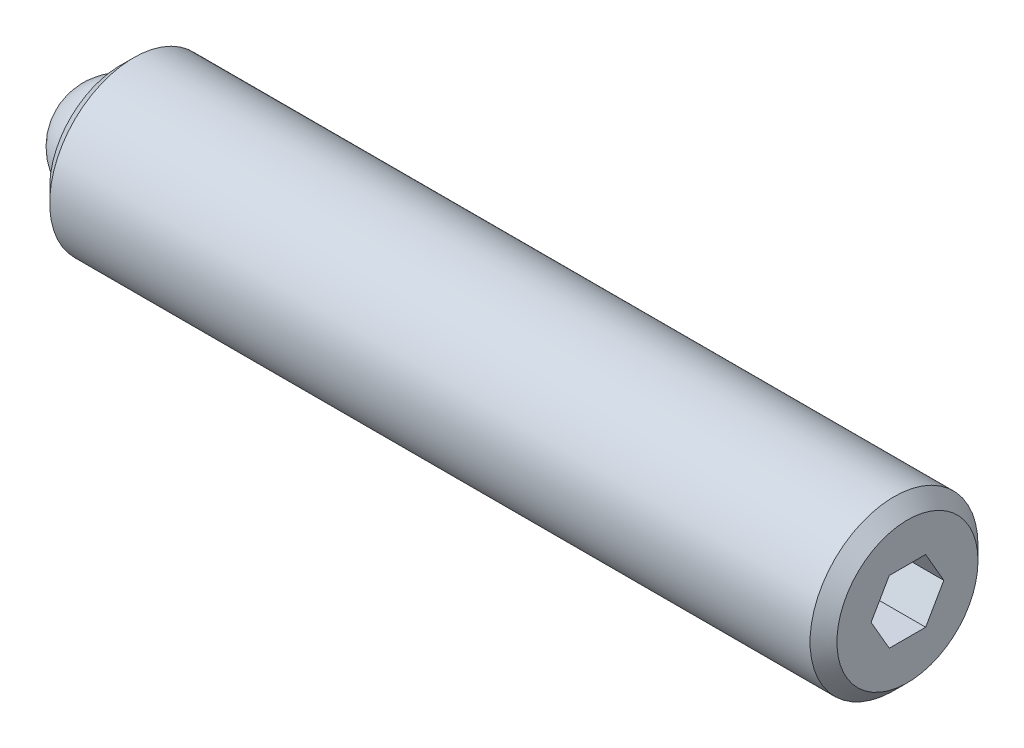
ISO-10303-21;
HEADER;
FILE_DESCRIPTION(('STEP AP214'),'2;1');
FILE_NAME('part.step','',(''),(''),'','','');
FILE_SCHEMA(('AUTOMOTIVE_DESIGN { 1 0 10303 214 1 1 1 1 }'));
ENDSEC;
DATA;
#1=APPLICATION_CONTEXT('core data for automotive mechanical design processes');
#2=APPLICATION_PROTOCOL_DEFINITION('international standard','automotive_design',2000,#1);
#3=PRODUCT_CONTEXT('',#1,'mechanical');
#4=PRODUCT('Part','Part','',(#3));
#5=PRODUCT_RELATED_PRODUCT_CATEGORY('part','',(#4));
#6=PRODUCT_DEFINITION_FORMATION('','',#4);
#7=PRODUCT_DEFINITION_CONTEXT('part definition',#1,'design');
#8=PRODUCT_DEFINITION('design','',#6,#7);
#9=PRODUCT_DEFINITION_SHAPE('','',#8);
#10=(LENGTH_UNIT() NAMED_UNIT(*) SI_UNIT(.MILLI.,.METRE.));
#11=(NAMED_UNIT(*) PLANE_ANGLE_UNIT() SI_UNIT($,.RADIAN.));
#12=(NAMED_UNIT(*) SI_UNIT($,.STERADIAN.) SOLID_ANGLE_UNIT());
#13=UNCERTAINTY_MEASURE_WITH_UNIT(LENGTH_MEASURE(1.E-05),#10,'distance_accuracy_value','');
#14=(GEOMETRIC_REPRESENTATION_CONTEXT(3) GLOBAL_UNCERTAINTY_ASSIGNED_CONTEXT((#13)) GLOBAL_UNIT_ASSIGNED_CONTEXT((#10,
#11,#12)) REPRESENTATION_CONTEXT('',''));
#15=CARTESIAN_POINT('',(0.,0.,0.));
#16=DIRECTION('',(0.,0.,1.));
#17=DIRECTION('',(1.,0.,0.));
#18=AXIS2_PLACEMENT_3D('',#15,#16,#17);
#19=CARTESIAN_POINT('',(0.,0.,0.));
#20=DIRECTION('',(0.,-1.,0.));
#21=DIRECTION('',(0.,0.,1.));
#22=AXIS2_PLACEMENT_3D('',#19,#20,#21);
#23=SPHERICAL_SURFACE('',#22,1.984375);
#24=CARTESIAN_POINT('',(0.,-1.984375,0.));
#25=VERTEX_POINT('',#24);
#26=VERTEX_LOOP('',#25);
#27=FACE_BOUND('',#26,.T.);
#28=ADVANCED_FACE('F43',(#27),#23,.T.);
#29=CLOSED_SHELL('',(#28));
#30=MANIFOLD_SOLID_BREP('B2',#29);
#31=CARTESIAN_POINT('',(29.765625,0.,0.));
#32=DIRECTION('',(-1.,0.,0.));
#33=DIRECTION('',(0.,0.,1.));
#34=AXIS2_PLACEMENT_3D('',#31,#32,#33);
#35=CYLINDRICAL_SURFACE('',#34,3.175);
#36=CARTESIAN_POINT('',(29.257625,0.,0.));
#37=DIRECTION('',(1.,0.,0.));
#38=DIRECTION('',(0.,0.,-1.));
#39=AXIS2_PLACEMENT_3D('',#36,#37,#38);
#40=CIRCLE('',#39,3.175);
#41=CARTESIAN_POINT('',(29.257625,0.,-3.175));
#42=VERTEX_POINT('',#41);
#43=EDGE_CURVE('E41',#42,#42,#40,.F.);
#44=ORIENTED_EDGE('',*,*,#43,.T.);
#45=EDGE_LOOP('',(#44));
#46=FACE_BOUND('',#45,.T.);
#47=CARTESIAN_POINT('',(0.508000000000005,0.,0.));
#48=DIRECTION('',(1.,0.,0.));
#49=DIRECTION('',(0.,0.,-1.));
#50=AXIS2_PLACEMENT_3D('',#47,#48,#49);
#51=CIRCLE('',#50,3.175);
#52=CARTESIAN_POINT('',(0.508000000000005,0.,-3.175));
#53=VERTEX_POINT('',#52);
#54=EDGE_CURVE('E159',#53,#53,#51,.T.);
#55=ORIENTED_EDGE('',*,*,#54,.T.);
#56=EDGE_LOOP('',(#55));
#57=FACE_BOUND('',#56,.T.);
#58=ADVANCED_FACE('F56',(#46,#57),#35,.T.);
#59=CARTESIAN_POINT('',(29.765625,0.,0.));
#60=DIRECTION('',(1.,0.,0.));
#61=DIRECTION('',(0.,0.,-1.));
#62=AXIS2_PLACEMENT_3D('',#59,#60,#61);
#63=PLANE('',#62);
#64=DIRECTION('',(0.,0.866025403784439,-0.5));
#65=VECTOR('',#64,1.);
#66=CARTESIAN_POINT('',(29.765625,-1.190625,-0.687407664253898));
#67=LINE('',#66,#65);
#68=CARTESIAN_POINT('',(29.765625,-1.190625,-0.687407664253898));
#69=VERTEX_POINT('',#68);
#70=CARTESIAN_POINT('',(29.765625,0.,-1.3748153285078));
#71=VERTEX_POINT('',#70);
#72=EDGE_CURVE('E71',#69,#71,#67,.T.);
#73=ORIENTED_EDGE('',*,*,#72,.F.);
#74=DIRECTION('',(0.,0.,-1.));
#75=VECTOR('',#74,1.);
#76=CARTESIAN_POINT('',(29.765625,-1.190625,0.687407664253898));
#77=LINE('',#76,#75);
#78=CARTESIAN_POINT('',(29.765625,-1.190625,0.687407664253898));
#79=VERTEX_POINT('',#78);
#80=EDGE_CURVE('E155',#79,#69,#77,.T.);
#81=ORIENTED_EDGE('',*,*,#80,.F.);
#82=DIRECTION('',(0.,-0.866025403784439,-0.5));
#83=VECTOR('',#82,1.);
#84=CARTESIAN_POINT('',(29.765625,0.,1.3748153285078));
#85=LINE('',#84,#83);
#86=CARTESIAN_POINT('',(29.765625,0.,1.3748153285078));
#87=VERTEX_POINT('',#86);
#88=EDGE_CURVE('E153',#87,#79,#85,.T.);
#89=ORIENTED_EDGE('',*,*,#88,.F.);
#90=DIRECTION('',(0.,-0.866025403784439,0.5));
#91=VECTOR('',#90,1.);
#92=CARTESIAN_POINT('',(29.765625,1.190625,0.687407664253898));
#93=LINE('',#92,#91);
#94=CARTESIAN_POINT('',(29.765625,1.190625,0.687407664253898));
#95=VERTEX_POINT('',#94);
#96=EDGE_CURVE('E119',#95,#87,#93,.T.);
#97=ORIENTED_EDGE('',*,*,#96,.F.);
#98=DIRECTION('',(0.,0.,1.));
#99=VECTOR('',#98,1.);
#100=CARTESIAN_POINT('',(29.765625,1.190625,-0.687407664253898));
#101=LINE('',#100,#99);
#102=CARTESIAN_POINT('',(29.765625,1.190625,-0.687407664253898));
#103=VERTEX_POINT('',#102);
#104=EDGE_CURVE('E149',#103,#95,#101,.T.);
#105=ORIENTED_EDGE('',*,*,#104,.F.);
#106=DIRECTION('',(0.,0.866025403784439,0.5));
#107=VECTOR('',#106,1.);
#108=CARTESIAN_POINT('',(29.765625,0.,-1.3748153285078));
#109=LINE('',#108,#107);
#110=EDGE_CURVE('E145',#71,#103,#109,.T.);
#111=ORIENTED_EDGE('',*,*,#110,.F.);
#112=EDGE_LOOP('',(#73,#81,#89,#97,#105,#111));
#113=FACE_BOUND('',#112,.T.);
#114=CARTESIAN_POINT('',(29.765625,0.,0.));
#115=DIRECTION('',(1.,0.,0.));
#116=DIRECTION('',(0.,0.,-1.));
#117=AXIS2_PLACEMENT_3D('',#114,#115,#116);
#118=CIRCLE('',#117,2.667);
#119=CARTESIAN_POINT('',(29.765625,0.,-2.667));
#120=VERTEX_POINT('',#119);
#121=EDGE_CURVE('E64',#120,#120,#118,.T.);
#122=ORIENTED_EDGE('',*,*,#121,.T.);
#123=EDGE_LOOP('',(#122));
#124=FACE_BOUND('',#123,.T.);
#125=ADVANCED_FACE('F172',(#113,#124),#63,.T.);
#126=CARTESIAN_POINT('',(0.,0.,0.));
#127=DIRECTION('',(1.,0.,0.));
#128=DIRECTION('',(0.,0.,-1.));
#129=AXIS2_PLACEMENT_3D('',#126,#127,#128);
#130=PLANE('',#129);
#131=CARTESIAN_POINT('',(0.,0.,0.));
#132=DIRECTION('',(-1.,0.,0.));
#133=DIRECTION('',(0.,0.,1.));
#134=AXIS2_PLACEMENT_3D('',#131,#132,#133);
#135=CIRCLE('',#134,1.9812);
#136=CARTESIAN_POINT('',(0.,0.,1.9812));
#137=VERTEX_POINT('',#136);
#138=EDGE_CURVE('E227',#137,#137,#135,.T.);
#139=ORIENTED_EDGE('',*,*,#138,.F.);
#140=EDGE_LOOP('',(#139));
#141=FACE_BOUND('',#140,.T.);
#142=CARTESIAN_POINT('',(0.,0.,0.));
#143=DIRECTION('',(1.,0.,0.));
#144=DIRECTION('',(0.,0.,-1.));
#145=AXIS2_PLACEMENT_3D('',#142,#143,#144);
#146=CIRCLE('',#145,2.66699999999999);
#147=CARTESIAN_POINT('',(0.,0.,-2.66699999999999));
#148=VERTEX_POINT('',#147);
#149=EDGE_CURVE('E167',#148,#148,#146,.F.);
#150=ORIENTED_EDGE('',*,*,#149,.T.);
#151=EDGE_LOOP('',(#150));
#152=FACE_BOUND('',#151,.T.);
#153=ADVANCED_FACE('F184',(#141,#152),#130,.F.);
#154=CARTESIAN_POINT('',(0.508000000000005,0.,0.));
#155=DIRECTION('',(1.,0.,0.));
#156=DIRECTION('',(0.,0.,-1.));
#157=AXIS2_PLACEMENT_3D('',#154,#155,#156);
#158=CONICAL_SURFACE('',#157,3.175,0.78539816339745);
#159=ORIENTED_EDGE('',*,*,#149,.F.);
#160=EDGE_LOOP('',(#159));
#161=FACE_BOUND('',#160,.T.);
#162=ORIENTED_EDGE('',*,*,#54,.F.);
#163=EDGE_LOOP('',(#162));
#164=FACE_BOUND('',#163,.T.);
#165=ADVANCED_FACE('F176',(#161,#164),#158,.T.);
#166=CARTESIAN_POINT('',(29.765625,0.,0.));
#167=DIRECTION('',(-1.,0.,0.));
#168=DIRECTION('',(0.,0.,1.));
#169=AXIS2_PLACEMENT_3D('',#166,#167,#168);
#170=CONICAL_SURFACE('',#169,2.667,0.785398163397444);
#171=ORIENTED_EDGE('',*,*,#43,.F.);
#172=EDGE_LOOP('',(#171));
#173=FACE_BOUND('',#172,.T.);
#174=ORIENTED_EDGE('',*,*,#121,.F.);
#175=EDGE_LOOP('',(#174));
#176=FACE_BOUND('',#175,.T.);
#177=ADVANCED_FACE('F58',(#173,#176),#170,.T.);
#178=CARTESIAN_POINT('',(27.479625,-1.190625,-0.687407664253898));
#179=DIRECTION('',(0.,-0.5,-0.866025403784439));
#180=DIRECTION('',(0.,0.866025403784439,-0.5));
#181=AXIS2_PLACEMENT_3D('',#178,#179,#180);
#182=PLANE('',#181);
#183=ORIENTED_EDGE('',*,*,#72,.T.);
#184=DIRECTION('',(1.,0.,0.));
#185=VECTOR('',#184,1.);
#186=CARTESIAN_POINT('',(27.479625,0.,-1.3748153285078));
#187=LINE('',#186,#185);
#188=CARTESIAN_POINT('',(27.479625,0.,-1.3748153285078));
#189=VERTEX_POINT('',#188);
#190=EDGE_CURVE('E101',#189,#71,#187,.T.);
#191=ORIENTED_EDGE('',*,*,#190,.F.);
#192=DIRECTION('',(0.,0.866025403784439,-0.5));
#193=VECTOR('',#192,1.);
#194=CARTESIAN_POINT('',(27.479625,-1.190625,-0.687407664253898));
#195=LINE('',#194,#193);
#196=CARTESIAN_POINT('',(27.479625,-1.190625,-0.687407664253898));
#197=VERTEX_POINT('',#196);
#198=EDGE_CURVE('E157',#197,#189,#195,.T.);
#199=ORIENTED_EDGE('',*,*,#198,.F.);
#200=DIRECTION('',(1.,0.,0.));
#201=VECTOR('',#200,1.);
#202=CARTESIAN_POINT('',(27.479625,-1.190625,-0.687407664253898));
#203=LINE('',#202,#201);
#204=EDGE_CURVE('E79',#197,#69,#203,.T.);
#205=ORIENTED_EDGE('',*,*,#204,.T.);
#206=EDGE_LOOP('',(#183,#191,#199,#205));
#207=FACE_BOUND('',#206,.T.);
#208=ADVANCED_FACE('F175',(#207),#182,.F.);
#209=CARTESIAN_POINT('',(27.479625,-1.190625,0.687407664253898));
#210=DIRECTION('',(0.,-1.,0.));
#211=DIRECTION('',(0.,0.,-1.));
#212=AXIS2_PLACEMENT_3D('',#209,#210,#211);
#213=PLANE('',#212);
#214=ORIENTED_EDGE('',*,*,#80,.T.);
#215=ORIENTED_EDGE('',*,*,#204,.F.);
#216=DIRECTION('',(0.,0.,-1.));
#217=VECTOR('',#216,1.);
#218=CARTESIAN_POINT('',(27.479625,-1.190625,0.687407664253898));
#219=LINE('',#218,#217);
#220=CARTESIAN_POINT('',(27.479625,-1.190625,0.687407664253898));
#221=VERTEX_POINT('',#220);
#222=EDGE_CURVE('E131',#221,#197,#219,.T.);
#223=ORIENTED_EDGE('',*,*,#222,.F.);
#224=DIRECTION('',(1.,0.,0.));
#225=VECTOR('',#224,1.);
#226=CARTESIAN_POINT('',(27.479625,-1.190625,0.687407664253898));
#227=LINE('',#226,#225);
#228=EDGE_CURVE('E123',#221,#79,#227,.T.);
#229=ORIENTED_EDGE('',*,*,#228,.T.);
#230=EDGE_LOOP('',(#214,#215,#223,#229));
#231=FACE_BOUND('',#230,.T.);
#232=ADVANCED_FACE('F182',(#231),#213,.F.);
#233=CARTESIAN_POINT('',(27.479625,0.,1.3748153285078));
#234=DIRECTION('',(0.,-0.5,0.866025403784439));
#235=DIRECTION('',(0.,-0.866025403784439,-0.5));
#236=AXIS2_PLACEMENT_3D('',#233,#234,#235);
#237=PLANE('',#236);
#238=ORIENTED_EDGE('',*,*,#88,.T.);
#239=ORIENTED_EDGE('',*,*,#228,.F.);
#240=DIRECTION('',(0.,-0.866025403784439,-0.5));
#241=VECTOR('',#240,1.);
#242=CARTESIAN_POINT('',(27.479625,0.,1.3748153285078));
#243=LINE('',#242,#241);
#244=CARTESIAN_POINT('',(27.479625,0.,1.3748153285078));
#245=VERTEX_POINT('',#244);
#246=EDGE_CURVE('E127',#245,#221,#243,.T.);
#247=ORIENTED_EDGE('',*,*,#246,.F.);
#248=DIRECTION('',(1.,0.,0.));
#249=VECTOR('',#248,1.);
#250=CARTESIAN_POINT('',(27.479625,0.,1.3748153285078));
#251=LINE('',#250,#249);
#252=EDGE_CURVE('E112',#245,#87,#251,.T.);
#253=ORIENTED_EDGE('',*,*,#252,.T.);
#254=EDGE_LOOP('',(#238,#239,#247,#253));
#255=FACE_BOUND('',#254,.T.);
#256=ADVANCED_FACE('F128',(#255),#237,.F.);
#257=CARTESIAN_POINT('',(27.479625,1.190625,0.687407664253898));
#258=DIRECTION('',(0.,0.5,0.866025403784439));
#259=DIRECTION('',(0.,-0.866025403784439,0.5));
#260=AXIS2_PLACEMENT_3D('',#257,#258,#259);
#261=PLANE('',#260);
#262=ORIENTED_EDGE('',*,*,#96,.T.);
#263=ORIENTED_EDGE('',*,*,#252,.F.);
#264=DIRECTION('',(0.,-0.866025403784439,0.5));
#265=VECTOR('',#264,1.);
#266=CARTESIAN_POINT('',(27.479625,1.190625,0.687407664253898));
#267=LINE('',#266,#265);
#268=CARTESIAN_POINT('',(27.479625,1.190625,0.687407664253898));
#269=VERTEX_POINT('',#268);
#270=EDGE_CURVE('E116',#269,#245,#267,.T.);
#271=ORIENTED_EDGE('',*,*,#270,.F.);
#272=DIRECTION('',(1.,0.,0.));
#273=VECTOR('',#272,1.);
#274=CARTESIAN_POINT('',(27.479625,1.190625,0.687407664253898));
#275=LINE('',#274,#273);
#276=EDGE_CURVE('E124',#269,#95,#275,.T.);
#277=ORIENTED_EDGE('',*,*,#276,.T.);
#278=EDGE_LOOP('',(#262,#263,#271,#277));
#279=FACE_BOUND('',#278,.T.);
#280=ADVANCED_FACE('F114',(#279),#261,.F.);
#281=CARTESIAN_POINT('',(27.479625,1.190625,-0.687407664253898));
#282=DIRECTION('',(0.,1.,0.));
#283=DIRECTION('',(0.,0.,1.));
#284=AXIS2_PLACEMENT_3D('',#281,#282,#283);
#285=PLANE('',#284);
#286=ORIENTED_EDGE('',*,*,#104,.T.);
#287=ORIENTED_EDGE('',*,*,#276,.F.);
#288=DIRECTION('',(0.,0.,1.));
#289=VECTOR('',#288,1.);
#290=CARTESIAN_POINT('',(27.479625,1.190625,-0.687407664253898));
#291=LINE('',#290,#289);
#292=CARTESIAN_POINT('',(27.479625,1.190625,-0.687407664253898));
#293=VERTEX_POINT('',#292);
#294=EDGE_CURVE('E137',#293,#269,#291,.T.);
#295=ORIENTED_EDGE('',*,*,#294,.F.);
#296=DIRECTION('',(1.,0.,0.));
#297=VECTOR('',#296,1.);
#298=CARTESIAN_POINT('',(27.479625,1.190625,-0.687407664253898));
#299=LINE('',#298,#297);
#300=EDGE_CURVE('E162',#293,#103,#299,.T.);
#301=ORIENTED_EDGE('',*,*,#300,.T.);
#302=EDGE_LOOP('',(#286,#287,#295,#301));
#303=FACE_BOUND('',#302,.T.);
#304=ADVANCED_FACE('F203',(#303),#285,.F.);
#305=CARTESIAN_POINT('',(27.479625,0.,-1.3748153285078));
#306=DIRECTION('',(0.,0.5,-0.866025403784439));
#307=DIRECTION('',(0.,0.866025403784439,0.5));
#308=AXIS2_PLACEMENT_3D('',#305,#306,#307);
#309=PLANE('',#308);
#310=ORIENTED_EDGE('',*,*,#110,.T.);
#311=ORIENTED_EDGE('',*,*,#300,.F.);
#312=DIRECTION('',(0.,0.866025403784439,0.5));
#313=VECTOR('',#312,1.);
#314=CARTESIAN_POINT('',(27.479625,0.,-1.3748153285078));
#315=LINE('',#314,#313);
#316=EDGE_CURVE('E139',#189,#293,#315,.T.);
#317=ORIENTED_EDGE('',*,*,#316,.F.);
#318=ORIENTED_EDGE('',*,*,#190,.T.);
#319=EDGE_LOOP('',(#310,#311,#317,#318));
#320=FACE_BOUND('',#319,.T.);
#321=ADVANCED_FACE('F200',(#320),#309,.F.);
#322=CARTESIAN_POINT('',(27.479625,0.,0.));
#323=DIRECTION('',(1.,0.,0.));
#324=DIRECTION('',(0.,0.,-1.));
#325=AXIS2_PLACEMENT_3D('',#322,#323,#324);
#326=PLANE('',#325);
#327=ORIENTED_EDGE('',*,*,#198,.T.);
#328=ORIENTED_EDGE('',*,*,#316,.T.);
#329=ORIENTED_EDGE('',*,*,#294,.T.);
#330=ORIENTED_EDGE('',*,*,#270,.T.);
#331=ORIENTED_EDGE('',*,*,#246,.T.);
#332=ORIENTED_EDGE('',*,*,#222,.T.);
#333=EDGE_LOOP('',(#327,#328,#329,#330,#331,#332));
#334=FACE_BOUND('',#333,.T.);
#335=ADVANCED_FACE('F134',(#334),#326,.T.);
#336=CARTESIAN_POINT('',(1.984375,0.,0.));
#337=DIRECTION('',(-1.,0.,0.));
#338=DIRECTION('',(0.,0.,1.));
#339=AXIS2_PLACEMENT_3D('',#336,#337,#338);
#340=CYLINDRICAL_SURFACE('',#339,1.9812);
#341=CARTESIAN_POINT('',(1.984375,0.,0.));
#342=DIRECTION('',(-1.,0.,0.));
#343=DIRECTION('',(0.,0.,1.));
#344=AXIS2_PLACEMENT_3D('',#341,#342,#343);
#345=CIRCLE('',#344,1.9812);
#346=CARTESIAN_POINT('',(1.984375,0.,1.9812));
#347=VERTEX_POINT('',#346);
#348=EDGE_CURVE('E146',#347,#347,#345,.T.);
#349=ORIENTED_EDGE('',*,*,#348,.F.);
#350=EDGE_LOOP('',(#349));
#351=FACE_BOUND('',#350,.T.);
#352=ORIENTED_EDGE('',*,*,#138,.T.);
#353=EDGE_LOOP('',(#352));
#354=FACE_BOUND('',#353,.T.);
#355=ADVANCED_FACE('F216',(#351,#354),#340,.F.);
#356=CARTESIAN_POINT('',(1.984375,0.,0.));
#357=DIRECTION('',(-1.,0.,0.));
#358=DIRECTION('',(0.,0.,1.));
#359=AXIS2_PLACEMENT_3D('',#356,#357,#358);
#360=PLANE('',#359);
#361=ORIENTED_EDGE('',*,*,#348,.T.);
#362=EDGE_LOOP('',(#361));
#363=FACE_BOUND('',#362,.T.);
#364=ADVANCED_FACE('F219',(#363),#360,.T.);
#365=CLOSED_SHELL('',(#58,#125,#153,#165,#177,#208,#232,#256,#280,#304,#321,#335,#355,#364));
#366=MANIFOLD_SOLID_BREP('B6',#365);
#367=ADVANCED_BREP_SHAPE_REPRESENTATION('',(#18,#30,#366),#14);
#368=SHAPE_DEFINITION_REPRESENTATION(#9,#367);
ENDSEC;
END-ISO-10303-21;
